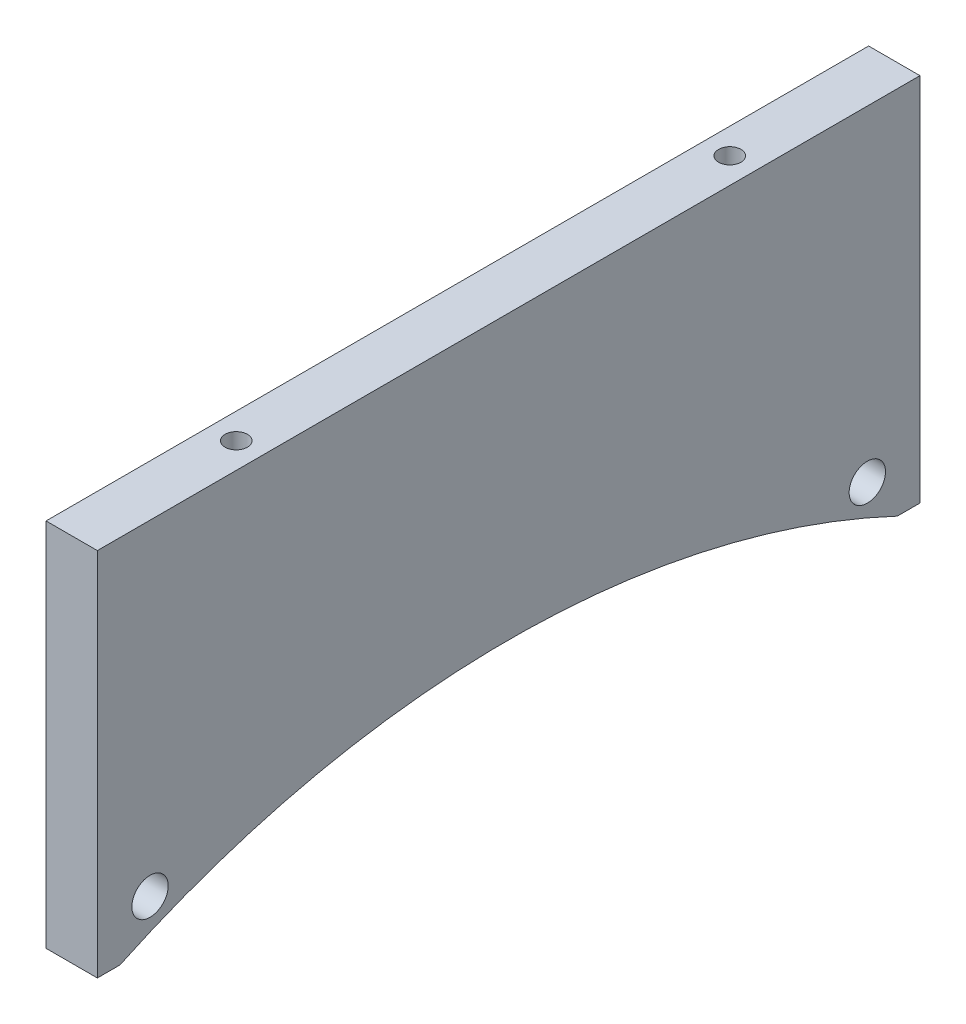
ISO-10303-21;
HEADER;
FILE_DESCRIPTION(('STEP AP214'),'2;1');
FILE_NAME('part.step','',(''),(''),'','','');
FILE_SCHEMA(('AUTOMOTIVE_DESIGN { 1 0 10303 214 1 1 1 1 }'));
ENDSEC;
DATA;
#1=APPLICATION_CONTEXT('core data for automotive mechanical design processes');
#2=APPLICATION_PROTOCOL_DEFINITION('international standard','automotive_design',2000,#1);
#3=PRODUCT_CONTEXT('',#1,'mechanical');
#4=PRODUCT('Part','Part','',(#3));
#5=PRODUCT_RELATED_PRODUCT_CATEGORY('part','',(#4));
#6=PRODUCT_DEFINITION_FORMATION('','',#4);
#7=PRODUCT_DEFINITION_CONTEXT('part definition',#1,'design');
#8=PRODUCT_DEFINITION('design','',#6,#7);
#9=PRODUCT_DEFINITION_SHAPE('','',#8);
#10=(LENGTH_UNIT() NAMED_UNIT(*) SI_UNIT(.MILLI.,.METRE.));
#11=(NAMED_UNIT(*) PLANE_ANGLE_UNIT() SI_UNIT($,.RADIAN.));
#12=(NAMED_UNIT(*) SI_UNIT($,.STERADIAN.) SOLID_ANGLE_UNIT());
#13=UNCERTAINTY_MEASURE_WITH_UNIT(LENGTH_MEASURE(1.E-05),#10,'distance_accuracy_value','');
#14=(GEOMETRIC_REPRESENTATION_CONTEXT(3) GLOBAL_UNCERTAINTY_ASSIGNED_CONTEXT((#13)) GLOBAL_UNIT_ASSIGNED_CONTEXT((#10,
#11,#12)) REPRESENTATION_CONTEXT('',''));
#15=CARTESIAN_POINT('',(0.,0.,0.));
#16=DIRECTION('',(0.,0.,1.));
#17=DIRECTION('',(1.,0.,0.));
#18=AXIS2_PLACEMENT_3D('',#15,#16,#17);
#19=CARTESIAN_POINT('',(0.,-119.684739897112,76.073980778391));
#20=DIRECTION('',(1.,0.,0.));
#21=DIRECTION('',(0.,0.,-1.));
#22=AXIS2_PLACEMENT_3D('',#19,#20,#21);
#23=PLANE('',#22);
#24=CARTESIAN_POINT('',(0.,-119.684739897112,76.073980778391));
#25=DIRECTION('',(-1.,0.,0.));
#26=DIRECTION('',(0.,0.,-1.));
#27=AXIS2_PLACEMENT_3D('',#24,#25,#26);
#28=CIRCLE('',#27,140.462);
#29=CARTESIAN_POINT('',(0.,9.2906759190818,20.4420155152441));
#30=VERTEX_POINT('',#29);
#31=CARTESIAN_POINT('',(0.,7.31526010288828,16.0692022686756));
#32=VERTEX_POINT('',#31);
#33=EDGE_CURVE('E180',#30,#32,#28,.T.);
#34=ORIENTED_EDGE('',*,*,#33,.F.);
#35=CARTESIAN_POINT('',(0.,14.1732601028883,20.701980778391));
#36=DIRECTION('',(-1.,0.,0.));
#37=DIRECTION('',(0.,0.,1.));
#38=AXIS2_PLACEMENT_3D('',#35,#36,#37);
#39=CIRCLE('',#38,4.8895);
#40=CARTESIAN_POINT('',(0.,10.9011533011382,24.3352337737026));
#41=VERTEX_POINT('',#40);
#42=EDGE_CURVE('E142',#41,#30,#39,.T.);
#43=ORIENTED_EDGE('',*,*,#42,.F.);
#44=CARTESIAN_POINT('',(0.,10.9011533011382,127.812727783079));
#45=VERTEX_POINT('',#44);
#46=EDGE_CURVE('E185',#45,#41,#28,.T.);
#47=ORIENTED_EDGE('',*,*,#46,.F.);
#48=CARTESIAN_POINT('',(0.,14.1732601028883,131.445980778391));
#49=DIRECTION('',(-1.,0.,0.));
#50=DIRECTION('',(0.,0.,1.));
#51=AXIS2_PLACEMENT_3D('',#48,#49,#50);
#52=CIRCLE('',#51,4.8895);
#53=CARTESIAN_POINT('',(0.,9.29067591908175,131.705946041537));
#54=VERTEX_POINT('',#53);
#55=EDGE_CURVE('E151',#54,#45,#52,.T.);
#56=ORIENTED_EDGE('',*,*,#55,.F.);
#57=CARTESIAN_POINT('',(0.,7.31526010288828,136.078759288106));
#58=VERTEX_POINT('',#57);
#59=EDGE_CURVE('E181',#58,#54,#28,.T.);
#60=ORIENTED_EDGE('',*,*,#59,.F.);
#61=DIRECTION('',(0.,0.,-1.));
#62=VECTOR('',#61,1.);
#63=CARTESIAN_POINT('',(0.,7.31526010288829,139.573980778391));
#64=LINE('',#63,#62);
#65=CARTESIAN_POINT('',(0.,7.31526010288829,139.573980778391));
#66=VERTEX_POINT('',#65);
#67=EDGE_CURVE('E178',#66,#58,#64,.T.);
#68=ORIENTED_EDGE('',*,*,#67,.F.);
#69=DIRECTION('',(0.,-1.,0.));
#70=VECTOR('',#69,1.);
#71=CARTESIAN_POINT('',(0.,7.31526010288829,139.573980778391));
#72=LINE('',#71,#70);
#73=CARTESIAN_POINT('',(0.,64.4652601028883,139.573980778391));
#74=VERTEX_POINT('',#73);
#75=EDGE_CURVE('E160',#74,#66,#72,.T.);
#76=ORIENTED_EDGE('',*,*,#75,.F.);
#77=DIRECTION('',(0.,0.,1.));
#78=VECTOR('',#77,1.);
#79=CARTESIAN_POINT('',(0.,64.4652601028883,12.573980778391));
#80=LINE('',#79,#78);
#81=CARTESIAN_POINT('',(0.,64.4652601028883,12.573980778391));
#82=VERTEX_POINT('',#81);
#83=EDGE_CURVE('E165',#82,#74,#80,.T.);
#84=ORIENTED_EDGE('',*,*,#83,.F.);
#85=DIRECTION('',(0.,1.,0.));
#86=VECTOR('',#85,1.);
#87=CARTESIAN_POINT('',(0.,7.31526010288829,12.573980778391));
#88=LINE('',#87,#86);
#89=CARTESIAN_POINT('',(0.,7.31526010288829,12.573980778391));
#90=VERTEX_POINT('',#89);
#91=EDGE_CURVE('E187',#90,#82,#88,.T.);
#92=ORIENTED_EDGE('',*,*,#91,.F.);
#93=DIRECTION('',(0.,0.,-1.));
#94=VECTOR('',#93,1.);
#95=CARTESIAN_POINT('',(0.,7.31526010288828,16.0692022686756));
#96=LINE('',#95,#94);
#97=EDGE_CURVE('E184',#32,#90,#96,.T.);
#98=ORIENTED_EDGE('',*,*,#97,.F.);
#99=EDGE_LOOP('',(#34,#43,#47,#56,#60,#68,#76,#84,#92,#98));
#100=FACE_BOUND('',#99,.T.);
#101=ADVANCED_FACE('F40',(#100),#23,.F.);
#102=CARTESIAN_POINT('',(7.9248,7.31526010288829,139.573980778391));
#103=DIRECTION('',(0.,0.,-1.));
#104=DIRECTION('',(0.,1.,0.));
#105=AXIS2_PLACEMENT_3D('',#102,#103,#104);
#106=PLANE('',#105);
#107=ORIENTED_EDGE('',*,*,#75,.T.);
#108=DIRECTION('',(-1.,0.,0.));
#109=VECTOR('',#108,1.);
#110=CARTESIAN_POINT('',(7.9248,7.31526010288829,139.573980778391));
#111=LINE('',#110,#109);
#112=CARTESIAN_POINT('',(7.9248,7.31526010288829,139.573980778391));
#113=VERTEX_POINT('',#112);
#114=EDGE_CURVE('E204',#113,#66,#111,.T.);
#115=ORIENTED_EDGE('',*,*,#114,.F.);
#116=DIRECTION('',(0.,-1.,0.));
#117=VECTOR('',#116,1.);
#118=CARTESIAN_POINT('',(7.9248,7.31526010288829,139.573980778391));
#119=LINE('',#118,#117);
#120=CARTESIAN_POINT('',(7.9248,64.4652601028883,139.573980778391));
#121=VERTEX_POINT('',#120);
#122=EDGE_CURVE('E161',#121,#113,#119,.T.);
#123=ORIENTED_EDGE('',*,*,#122,.F.);
#124=DIRECTION('',(-1.,0.,0.));
#125=VECTOR('',#124,1.);
#126=CARTESIAN_POINT('',(7.9248,64.4652601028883,139.573980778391));
#127=LINE('',#126,#125);
#128=EDGE_CURVE('E175',#121,#74,#127,.T.);
#129=ORIENTED_EDGE('',*,*,#128,.T.);
#130=EDGE_LOOP('',(#107,#115,#123,#129));
#131=FACE_BOUND('',#130,.T.);
#132=ADVANCED_FACE('F42',(#131),#106,.F.);
#133=CARTESIAN_POINT('',(7.9248,7.31526010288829,139.573980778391));
#134=DIRECTION('',(0.,1.,0.));
#135=DIRECTION('',(0.,0.,1.));
#136=AXIS2_PLACEMENT_3D('',#133,#134,#135);
#137=PLANE('',#136);
#138=ORIENTED_EDGE('',*,*,#67,.T.);
#139=DIRECTION('',(-1.,0.,0.));
#140=VECTOR('',#139,1.);
#141=CARTESIAN_POINT('',(7.9248,7.31526010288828,136.078759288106));
#142=LINE('',#141,#140);
#143=CARTESIAN_POINT('',(7.9248,7.31526010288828,136.078759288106));
#144=VERTEX_POINT('',#143);
#145=EDGE_CURVE('E201',#144,#58,#142,.T.);
#146=ORIENTED_EDGE('',*,*,#145,.F.);
#147=DIRECTION('',(0.,0.,-1.));
#148=VECTOR('',#147,1.);
#149=CARTESIAN_POINT('',(7.9248,7.31526010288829,139.573980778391));
#150=LINE('',#149,#148);
#151=EDGE_CURVE('E164',#113,#144,#150,.T.);
#152=ORIENTED_EDGE('',*,*,#151,.F.);
#153=ORIENTED_EDGE('',*,*,#114,.T.);
#154=EDGE_LOOP('',(#138,#146,#152,#153));
#155=FACE_BOUND('',#154,.T.);
#156=ADVANCED_FACE('F256',(#155),#137,.F.);
#157=CARTESIAN_POINT('',(7.9248,-119.684739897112,76.073980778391));
#158=DIRECTION('',(-1.,0.,0.));
#159=DIRECTION('',(0.,0.,1.));
#160=AXIS2_PLACEMENT_3D('',#157,#158,#159);
#161=CYLINDRICAL_SURFACE('',#160,140.462);
#162=CARTESIAN_POINT('',(1.01579999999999,10.9012974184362,24.3355975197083));
#163=CARTESIAN_POINT('',(1.07242411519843,10.8604844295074,24.2325873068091));
#164=CARTESIAN_POINT('',(1.12625214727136,10.818988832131,24.1282092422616));
#165=CARTESIAN_POINT('',(1.22705089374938,10.7345059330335,23.9164616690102));
#166=CARTESIAN_POINT('',(1.27400553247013,10.6915154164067,23.8090858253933));
#167=CARTESIAN_POINT('',(1.35938718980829,10.604238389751,23.5918959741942));
#168=CARTESIAN_POINT('',(1.39784000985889,10.5599562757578,23.482090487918));
#169=CARTESIAN_POINT('',(1.46486233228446,10.4700752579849,23.2600444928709));
#170=CARTESIAN_POINT('',(1.49343601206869,10.4244769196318,23.1478050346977));
#171=CARTESIAN_POINT('',(1.5366327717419,10.3375931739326,22.9347487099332));
#172=CARTESIAN_POINT('',(1.55249893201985,10.2964291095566,22.8341359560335));
#173=CARTESIAN_POINT('',(1.57475548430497,10.2134886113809,22.6320908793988));
#174=CARTESIAN_POINT('',(1.58114504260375,10.1717121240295,22.5306584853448));
#175=CARTESIAN_POINT('',(1.5841331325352,10.0878737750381,22.3277787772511));
#176=CARTESIAN_POINT('',(1.58073280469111,10.0458119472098,22.2263314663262));
#177=CARTESIAN_POINT('',(1.56431467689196,9.96173867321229,22.0242257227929));
#178=CARTESIAN_POINT('',(1.55129794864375,9.91972722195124,21.9235672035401));
#179=CARTESIAN_POINT('',(1.51259296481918,9.82733635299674,21.702916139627));
#180=CARTESIAN_POINT('',(1.48483268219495,9.77703336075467,21.583255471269));
#181=CARTESIAN_POINT('',(1.41771649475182,9.67724373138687,21.346774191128));
#182=CARTESIAN_POINT('',(1.3783476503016,9.62775807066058,21.2299569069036));
#183=CARTESIAN_POINT('',(1.28965761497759,9.52960054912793,20.9990909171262));
#184=CARTESIAN_POINT('',(1.24028728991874,9.48093404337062,20.8850591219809));
#185=CARTESIAN_POINT('',(1.13358954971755,9.38483528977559,20.660687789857));
#186=CARTESIAN_POINT('',(1.07628552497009,9.33739988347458,20.5503385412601));
#187=CARTESIAN_POINT('',(1.01579999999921,9.29052095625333,20.4416562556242));
#188=B_SPLINE_CURVE_WITH_KNOTS('',3,(#162,#163,#164,#165,#166,#167,#168,#169,#170,#171,#172,
#173,#174,#175,#176,#177,#178,#179,#180,#181,#182,#183,#184,#185,#186,#187),.UNSPECIFIED.,.F.,
.F.,(4,2,2,2,2,2,2,2,2,2,2,2,4),(0.,0.373379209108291,0.747618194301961,1.12070535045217,
1.49363455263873,1.82282798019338,2.1520503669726,2.48123440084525,2.81038175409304,
3.20796931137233,3.60600173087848,4.00603916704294,4.40492136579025),.UNSPECIFIED.);
#189=CARTESIAN_POINT('',(1.016,10.9011533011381,24.3352337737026));
#190=VERTEX_POINT('',#189);
#191=CARTESIAN_POINT('',(1.01600000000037,9.29067591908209,20.4420155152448));
#192=VERTEX_POINT('',#191);
#193=EDGE_CURVE('E286',#190,#192,#188,.T.);
#194=ORIENTED_EDGE('',*,*,#193,.T.);
#195=DIRECTION('',(-1.,0.,0.));
#196=VECTOR('',#195,1.);
#197=CARTESIAN_POINT('',(0.508,9.29067591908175,20.4420155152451));
#198=LINE('',#197,#196);
#199=EDGE_CURVE('E11',#192,#30,#198,.T.);
#200=ORIENTED_EDGE('',*,*,#199,.T.);
#201=ORIENTED_EDGE('',*,*,#33,.T.);
#202=DIRECTION('',(-1.,0.,0.));
#203=VECTOR('',#202,1.);
#204=CARTESIAN_POINT('',(7.9248,7.31526010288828,16.0692022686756));
#205=LINE('',#204,#203);
#206=CARTESIAN_POINT('',(7.9248,7.31526010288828,16.0692022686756));
#207=VERTEX_POINT('',#206);
#208=EDGE_CURVE('E198',#207,#32,#205,.T.);
#209=ORIENTED_EDGE('',*,*,#208,.F.);
#210=CARTESIAN_POINT('',(7.9248,-119.684739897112,76.073980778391));
#211=DIRECTION('',(-1.,0.,0.));
#212=DIRECTION('',(0.,0.,-1.));
#213=AXIS2_PLACEMENT_3D('',#210,#211,#212);
#214=CIRCLE('',#213,140.462);
#215=EDGE_CURVE('E167',#144,#207,#214,.T.);
#216=ORIENTED_EDGE('',*,*,#215,.F.);
#217=ORIENTED_EDGE('',*,*,#145,.T.);
#218=ORIENTED_EDGE('',*,*,#59,.T.);
#219=DIRECTION('',(-1.,0.,0.));
#220=VECTOR('',#219,1.);
#221=CARTESIAN_POINT('',(0.508,9.29067591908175,131.705946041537));
#222=LINE('',#221,#220);
#223=CARTESIAN_POINT('',(1.016,9.29067591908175,131.705946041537));
#224=VERTEX_POINT('',#223);
#225=EDGE_CURVE('E207',#54,#224,#222,.F.);
#226=ORIENTED_EDGE('',*,*,#225,.T.);
#227=CARTESIAN_POINT('',(1.01579999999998,9.29052095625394,131.706305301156));
#228=CARTESIAN_POINT('',(1.07242411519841,9.33440528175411,131.60456558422));
#229=CARTESIAN_POINT('',(1.12625214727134,9.37877278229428,131.501375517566));
#230=CARTESIAN_POINT('',(1.22705089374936,9.4685652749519,131.291824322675));
#231=CARTESIAN_POINT('',(1.27400553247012,9.51399246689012,131.185456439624));
#232=CARTESIAN_POINT('',(1.35938718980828,9.60565200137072,130.970079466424));
#233=CARTESIAN_POINT('',(1.39784000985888,9.65188143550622,130.861079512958));
#234=CARTESIAN_POINT('',(1.46486233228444,9.74512851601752,130.640425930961));
#235=CARTESIAN_POINT('',(1.49343601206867,9.79214582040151,130.528773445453));
#236=CARTESIAN_POINT('',(1.53663277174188,9.88116361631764,130.316599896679));
#237=CARTESIAN_POINT('',(1.55249893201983,9.92310579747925,130.216309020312));
#238=CARTESIAN_POINT('',(1.57475548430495,10.0071357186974,130.014714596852));
#239=CARTESIAN_POINT('',(1.58114504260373,10.0492234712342,129.913410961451));
#240=CARTESIAN_POINT('',(1.5841331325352,10.1332075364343,129.710591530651));
#241=CARTESIAN_POINT('',(1.58073280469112,10.1751038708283,129.609075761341));
#242=CARTESIAN_POINT('',(1.56431467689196,10.2583749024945,129.406638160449));
#243=CARTESIAN_POINT('',(1.55129794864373,10.299749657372,129.305716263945));
#244=CARTESIAN_POINT('',(1.51259296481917,10.3902348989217,129.084276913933));
#245=CARTESIAN_POINT('',(1.48483268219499,10.4391650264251,128.964048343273));
#246=CARTESIAN_POINT('',(1.41771649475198,10.5355967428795,128.726178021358));
#247=CARTESIAN_POINT('',(1.37834765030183,10.5830966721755,128.608539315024));
#248=CARTESIAN_POINT('',(1.28965761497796,10.6767166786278,128.375796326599));
#249=CARTESIAN_POINT('',(1.24028728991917,10.7228285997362,128.260707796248));
#250=CARTESIAN_POINT('',(1.13358954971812,10.8133176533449,128.034015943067));
#251=CARTESIAN_POINT('',(1.07628552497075,10.8576994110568,127.922403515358));
#252=CARTESIAN_POINT('',(1.01579999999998,10.9012974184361,127.812364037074));
#253=B_SPLINE_CURVE_WITH_KNOTS('',3,(#227,#228,#229,#230,#231,#232,#233,#234,#235,#236,#237,
#238,#239,#240,#241,#242,#243,#244,#245,#246,#247,#248,#249,#250,#251,#252),.UNSPECIFIED.,.F.,
.F.,(4,2,2,2,2,2,2,2,2,2,2,2,4),(0.,0.37337920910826,0.747618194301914,1.12070535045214,
1.49363455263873,1.82282798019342,2.15205036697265,2.48123440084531,2.81038175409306,
3.20796931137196,3.60600173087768,4.00603916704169,4.40492136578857),.UNSPECIFIED.);
#254=CARTESIAN_POINT('',(1.016,10.9011533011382,127.812727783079));
#255=VERTEX_POINT('',#254);
#256=EDGE_CURVE('E210',#224,#255,#253,.T.);
#257=ORIENTED_EDGE('',*,*,#256,.T.);
#258=DIRECTION('',(-1.,0.,0.));
#259=VECTOR('',#258,1.);
#260=CARTESIAN_POINT('',(0.508,10.9011533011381,127.812727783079));
#261=LINE('',#260,#259);
#262=EDGE_CURVE('E218',#255,#45,#261,.T.);
#263=ORIENTED_EDGE('',*,*,#262,.T.);
#264=ORIENTED_EDGE('',*,*,#46,.T.);
#265=DIRECTION('',(-1.,0.,0.));
#266=VECTOR('',#265,1.);
#267=CARTESIAN_POINT('',(0.508,10.9011533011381,24.3352337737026));
#268=LINE('',#267,#266);
#269=EDGE_CURVE('E48',#41,#190,#268,.F.);
#270=ORIENTED_EDGE('',*,*,#269,.T.);
#271=EDGE_LOOP('',(#194,#200,#201,#209,#216,#217,#218,#226,#257,#263,#264,#270));
#272=FACE_BOUND('',#271,.T.);
#273=ADVANCED_FACE('F220',(#272),#161,.F.);
#274=CARTESIAN_POINT('',(7.9248,7.31526010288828,16.0692022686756));
#275=DIRECTION('',(0.,1.,0.));
#276=DIRECTION('',(0.,0.,1.));
#277=AXIS2_PLACEMENT_3D('',#274,#275,#276);
#278=PLANE('',#277);
#279=ORIENTED_EDGE('',*,*,#97,.T.);
#280=DIRECTION('',(-1.,0.,0.));
#281=VECTOR('',#280,1.);
#282=CARTESIAN_POINT('',(7.9248,7.31526010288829,12.573980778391));
#283=LINE('',#282,#281);
#284=CARTESIAN_POINT('',(7.9248,7.31526010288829,12.573980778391));
#285=VERTEX_POINT('',#284);
#286=EDGE_CURVE('E195',#285,#90,#283,.T.);
#287=ORIENTED_EDGE('',*,*,#286,.F.);
#288=DIRECTION('',(0.,0.,-1.));
#289=VECTOR('',#288,1.);
#290=CARTESIAN_POINT('',(7.9248,7.31526010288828,16.0692022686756));
#291=LINE('',#290,#289);
#292=EDGE_CURVE('E169',#207,#285,#291,.T.);
#293=ORIENTED_EDGE('',*,*,#292,.F.);
#294=ORIENTED_EDGE('',*,*,#208,.T.);
#295=EDGE_LOOP('',(#279,#287,#293,#294));
#296=FACE_BOUND('',#295,.T.);
#297=ADVANCED_FACE('F249',(#296),#278,.F.);
#298=CARTESIAN_POINT('',(7.9248,7.31526010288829,12.573980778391));
#299=DIRECTION('',(0.,0.,1.));
#300=DIRECTION('',(0.,-1.,0.));
#301=AXIS2_PLACEMENT_3D('',#298,#299,#300);
#302=PLANE('',#301);
#303=ORIENTED_EDGE('',*,*,#91,.T.);
#304=DIRECTION('',(-1.,0.,0.));
#305=VECTOR('',#304,1.);
#306=CARTESIAN_POINT('',(7.9248,64.4652601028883,12.573980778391));
#307=LINE('',#306,#305);
#308=CARTESIAN_POINT('',(7.9248,64.4652601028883,12.573980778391));
#309=VERTEX_POINT('',#308);
#310=EDGE_CURVE('E192',#309,#82,#307,.T.);
#311=ORIENTED_EDGE('',*,*,#310,.F.);
#312=DIRECTION('',(0.,1.,0.));
#313=VECTOR('',#312,1.);
#314=CARTESIAN_POINT('',(7.9248,7.31526010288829,12.573980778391));
#315=LINE('',#314,#313);
#316=EDGE_CURVE('E171',#285,#309,#315,.T.);
#317=ORIENTED_EDGE('',*,*,#316,.F.);
#318=ORIENTED_EDGE('',*,*,#286,.T.);
#319=EDGE_LOOP('',(#303,#311,#317,#318));
#320=FACE_BOUND('',#319,.T.);
#321=ADVANCED_FACE('F246',(#320),#302,.F.);
#322=CARTESIAN_POINT('',(7.9248,64.4652601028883,12.573980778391));
#323=DIRECTION('',(0.,-1.,0.));
#324=DIRECTION('',(0.,0.,-1.));
#325=AXIS2_PLACEMENT_3D('',#322,#323,#324);
#326=PLANE('',#325);
#327=CARTESIAN_POINT('',(3.9624,64.4652601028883,114.173980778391));
#328=DIRECTION('',(0.,1.,0.));
#329=DIRECTION('',(0.,0.,1.));
#330=AXIS2_PLACEMENT_3D('',#327,#328,#329);
#331=CIRCLE('',#330,1.72719999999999);
#332=CARTESIAN_POINT('',(3.9624,64.4652601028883,115.901180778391));
#333=VERTEX_POINT('',#332);
#334=EDGE_CURVE('E132',#333,#333,#331,.T.);
#335=ORIENTED_EDGE('',*,*,#334,.F.);
#336=EDGE_LOOP('',(#335));
#337=FACE_BOUND('',#336,.T.);
#338=CARTESIAN_POINT('',(3.9624,64.4652601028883,37.973980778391));
#339=DIRECTION('',(0.,1.,0.));
#340=DIRECTION('',(0.,0.,1.));
#341=AXIS2_PLACEMENT_3D('',#338,#339,#340);
#342=CIRCLE('',#341,1.72719999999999);
#343=CARTESIAN_POINT('',(3.9624,64.4652601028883,39.701180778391));
#344=VERTEX_POINT('',#343);
#345=EDGE_CURVE('E131',#344,#344,#342,.T.);
#346=ORIENTED_EDGE('',*,*,#345,.F.);
#347=EDGE_LOOP('',(#346));
#348=FACE_BOUND('',#347,.T.);
#349=ORIENTED_EDGE('',*,*,#83,.T.);
#350=ORIENTED_EDGE('',*,*,#128,.F.);
#351=DIRECTION('',(0.,0.,1.));
#352=VECTOR('',#351,1.);
#353=CARTESIAN_POINT('',(7.9248,64.4652601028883,12.573980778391));
#354=LINE('',#353,#352);
#355=EDGE_CURVE('E173',#309,#121,#354,.T.);
#356=ORIENTED_EDGE('',*,*,#355,.F.);
#357=ORIENTED_EDGE('',*,*,#310,.T.);
#358=EDGE_LOOP('',(#349,#350,#356,#357));
#359=FACE_BOUND('',#358,.T.);
#360=ADVANCED_FACE('F239',(#337,#348,#359),#326,.F.);
#361=CARTESIAN_POINT('',(7.9248,-119.684739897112,76.073980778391));
#362=DIRECTION('',(1.,0.,0.));
#363=DIRECTION('',(0.,0.,-1.));
#364=AXIS2_PLACEMENT_3D('',#361,#362,#363);
#365=PLANE('',#364);
#366=CARTESIAN_POINT('',(7.9248,14.1732601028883,20.701980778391));
#367=DIRECTION('',(-1.,0.,0.));
#368=DIRECTION('',(0.,0.,1.));
#369=AXIS2_PLACEMENT_3D('',#366,#367,#368);
#370=CIRCLE('',#369,2.8067);
#371=CARTESIAN_POINT('',(7.9248,14.1732601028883,23.508680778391));
#372=VERTEX_POINT('',#371);
#373=EDGE_CURVE('E148',#372,#372,#370,.T.);
#374=ORIENTED_EDGE('',*,*,#373,.T.);
#375=EDGE_LOOP('',(#374));
#376=FACE_BOUND('',#375,.T.);
#377=CARTESIAN_POINT('',(7.9248,14.1732601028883,131.445980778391));
#378=DIRECTION('',(-1.,0.,0.));
#379=DIRECTION('',(0.,0.,1.));
#380=AXIS2_PLACEMENT_3D('',#377,#378,#379);
#381=CIRCLE('',#380,2.8067);
#382=CARTESIAN_POINT('',(7.9248,14.1732601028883,134.252680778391));
#383=VERTEX_POINT('',#382);
#384=EDGE_CURVE('E157',#383,#383,#381,.T.);
#385=ORIENTED_EDGE('',*,*,#384,.T.);
#386=EDGE_LOOP('',(#385));
#387=FACE_BOUND('',#386,.T.);
#388=ORIENTED_EDGE('',*,*,#122,.T.);
#389=ORIENTED_EDGE('',*,*,#151,.T.);
#390=ORIENTED_EDGE('',*,*,#215,.T.);
#391=ORIENTED_EDGE('',*,*,#292,.T.);
#392=ORIENTED_EDGE('',*,*,#316,.T.);
#393=ORIENTED_EDGE('',*,*,#355,.T.);
#394=EDGE_LOOP('',(#388,#389,#390,#391,#392,#393));
#395=FACE_BOUND('',#394,.T.);
#396=ADVANCED_FACE('F229',(#376,#387,#395),#365,.T.);
#397=CARTESIAN_POINT('',(1.016,14.1732601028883,131.445980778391));
#398=DIRECTION('',(-1.,0.,0.));
#399=DIRECTION('',(0.,0.,1.));
#400=AXIS2_PLACEMENT_3D('',#397,#398,#399);
#401=CONICAL_SURFACE('',#400,4.8895,0.715584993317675);
#402=CARTESIAN_POINT('',(3.41198731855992,14.1732601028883,131.445980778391));
#403=DIRECTION('',(-1.,0.,0.));
#404=DIRECTION('',(0.,0.,1.));
#405=AXIS2_PLACEMENT_3D('',#402,#403,#404);
#406=CIRCLE('',#405,2.8067);
#407=CARTESIAN_POINT('',(3.41198731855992,14.1732601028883,134.252680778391));
#408=VERTEX_POINT('',#407);
#409=EDGE_CURVE('E154',#408,#408,#406,.T.);
#410=ORIENTED_EDGE('',*,*,#409,.F.);
#411=EDGE_LOOP('',(#410));
#412=FACE_BOUND('',#411,.T.);
#413=CARTESIAN_POINT('',(1.016,14.1732601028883,131.445980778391));
#414=DIRECTION('',(-1.,0.,0.));
#415=DIRECTION('',(0.,0.,1.));
#416=AXIS2_PLACEMENT_3D('',#413,#414,#415);
#417=CIRCLE('',#416,4.8895);
#418=EDGE_CURVE('E62',#224,#255,#417,.T.);
#419=ORIENTED_EDGE('',*,*,#418,.T.);
#420=ORIENTED_EDGE('',*,*,#256,.F.);
#421=EDGE_LOOP('',(#419,#420));
#422=FACE_BOUND('',#421,.T.);
#423=ADVANCED_FACE('F223',(#412,#422),#401,.F.);
#424=CARTESIAN_POINT('',(0.,14.1732601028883,131.445980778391));
#425=DIRECTION('',(-1.,0.,0.));
#426=DIRECTION('',(0.,0.,1.));
#427=AXIS2_PLACEMENT_3D('',#424,#425,#426);
#428=CYLINDRICAL_SURFACE('',#427,4.8895);
#429=ORIENTED_EDGE('',*,*,#418,.F.);
#430=ORIENTED_EDGE('',*,*,#225,.F.);
#431=ORIENTED_EDGE('',*,*,#55,.T.);
#432=ORIENTED_EDGE('',*,*,#262,.F.);
#433=EDGE_LOOP('',(#429,#430,#431,#432));
#434=FACE_BOUND('',#433,.T.);
#435=ADVANCED_FACE('F228',(#434),#428,.F.);
#436=CARTESIAN_POINT('',(0.,14.1732601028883,131.445980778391));
#437=DIRECTION('',(-1.,0.,0.));
#438=DIRECTION('',(0.,0.,1.));
#439=AXIS2_PLACEMENT_3D('',#436,#437,#438);
#440=CYLINDRICAL_SURFACE('',#439,2.8067);
#441=ORIENTED_EDGE('',*,*,#384,.F.);
#442=EDGE_LOOP('',(#441));
#443=FACE_BOUND('',#442,.T.);
#444=ORIENTED_EDGE('',*,*,#409,.T.);
#445=EDGE_LOOP('',(#444));
#446=FACE_BOUND('',#445,.T.);
#447=ADVANCED_FACE('F232',(#443,#446),#440,.F.);
#448=CARTESIAN_POINT('',(0.,14.1732601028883,20.701980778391));
#449=DIRECTION('',(-1.,0.,0.));
#450=DIRECTION('',(0.,0.,1.));
#451=AXIS2_PLACEMENT_3D('',#448,#449,#450);
#452=CYLINDRICAL_SURFACE('',#451,4.8895);
#453=CARTESIAN_POINT('',(1.016,14.1732601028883,20.701980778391));
#454=DIRECTION('',(-1.,0.,0.));
#455=DIRECTION('',(0.,0.,1.));
#456=AXIS2_PLACEMENT_3D('',#453,#454,#455);
#457=CIRCLE('',#456,4.8895);
#458=EDGE_CURVE('E54',#190,#192,#457,.T.);
#459=ORIENTED_EDGE('',*,*,#458,.F.);
#460=ORIENTED_EDGE('',*,*,#269,.F.);
#461=ORIENTED_EDGE('',*,*,#42,.T.);
#462=ORIENTED_EDGE('',*,*,#199,.F.);
#463=EDGE_LOOP('',(#459,#460,#461,#462));
#464=FACE_BOUND('',#463,.T.);
#465=ADVANCED_FACE('F235',(#464),#452,.F.);
#466=CARTESIAN_POINT('',(1.016,14.1732601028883,20.701980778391));
#467=DIRECTION('',(-1.,0.,0.));
#468=DIRECTION('',(0.,0.,1.));
#469=AXIS2_PLACEMENT_3D('',#466,#467,#468);
#470=CONICAL_SURFACE('',#469,4.8895,0.715584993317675);
#471=CARTESIAN_POINT('',(3.41198731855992,14.1732601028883,20.701980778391));
#472=DIRECTION('',(-1.,0.,0.));
#473=DIRECTION('',(0.,0.,1.));
#474=AXIS2_PLACEMENT_3D('',#471,#472,#473);
#475=CIRCLE('',#474,2.8067);
#476=CARTESIAN_POINT('',(3.41198731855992,14.1732601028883,23.508680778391));
#477=VERTEX_POINT('',#476);
#478=EDGE_CURVE('E145',#477,#477,#475,.T.);
#479=ORIENTED_EDGE('',*,*,#478,.F.);
#480=EDGE_LOOP('',(#479));
#481=FACE_BOUND('',#480,.T.);
#482=ORIENTED_EDGE('',*,*,#458,.T.);
#483=ORIENTED_EDGE('',*,*,#193,.F.);
#484=EDGE_LOOP('',(#482,#483));
#485=FACE_BOUND('',#484,.T.);
#486=ADVANCED_FACE('F291',(#481,#485),#470,.F.);
#487=CARTESIAN_POINT('',(0.,14.1732601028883,20.701980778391));
#488=DIRECTION('',(-1.,0.,0.));
#489=DIRECTION('',(0.,0.,1.));
#490=AXIS2_PLACEMENT_3D('',#487,#488,#489);
#491=CYLINDRICAL_SURFACE('',#490,2.8067);
#492=ORIENTED_EDGE('',*,*,#373,.F.);
#493=EDGE_LOOP('',(#492));
#494=FACE_BOUND('',#493,.T.);
#495=ORIENTED_EDGE('',*,*,#478,.T.);
#496=EDGE_LOOP('',(#495));
#497=FACE_BOUND('',#496,.T.);
#498=ADVANCED_FACE('F295',(#494,#497),#491,.F.);
#499=CARTESIAN_POINT('',(3.9624,54.3052601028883,37.973980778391));
#500=DIRECTION('',(0.,1.,0.));
#501=DIRECTION('',(0.,0.,1.));
#502=AXIS2_PLACEMENT_3D('',#499,#500,#501);
#503=CONICAL_SURFACE('',#502,1.7272,1.02974425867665);
#504=CARTESIAN_POINT('',(3.9624,53.2674536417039,37.973980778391));
#505=VERTEX_POINT('',#504);
#506=VERTEX_LOOP('',#505);
#507=FACE_BOUND('',#506,.T.);
#508=CARTESIAN_POINT('',(3.9624,54.3052601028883,37.973980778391));
#509=DIRECTION('',(0.,1.,0.));
#510=DIRECTION('',(0.,0.,1.));
#511=AXIS2_PLACEMENT_3D('',#508,#509,#510);
#512=CIRCLE('',#511,1.7272);
#513=CARTESIAN_POINT('',(3.9624,54.3052601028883,39.701180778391));
#514=VERTEX_POINT('',#513);
#515=EDGE_CURVE('E135',#514,#514,#512,.T.);
#516=ORIENTED_EDGE('',*,*,#515,.T.);
#517=EDGE_LOOP('',(#516));
#518=FACE_BOUND('',#517,.T.);
#519=ADVANCED_FACE('F299',(#507,#518),#503,.F.);
#520=CARTESIAN_POINT('',(3.9624,64.4652601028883,37.973980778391));
#521=DIRECTION('',(0.,1.,0.));
#522=DIRECTION('',(0.,0.,1.));
#523=AXIS2_PLACEMENT_3D('',#520,#521,#522);
#524=CYLINDRICAL_SURFACE('',#523,1.7272);
#525=ORIENTED_EDGE('',*,*,#515,.F.);
#526=EDGE_LOOP('',(#525));
#527=FACE_BOUND('',#526,.T.);
#528=ORIENTED_EDGE('',*,*,#345,.T.);
#529=EDGE_LOOP('',(#528));
#530=FACE_BOUND('',#529,.T.);
#531=ADVANCED_FACE('F125',(#527,#530),#524,.F.);
#532=CARTESIAN_POINT('',(3.9624,54.3052601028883,114.173980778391));
#533=DIRECTION('',(0.,1.,0.));
#534=DIRECTION('',(0.,0.,1.));
#535=AXIS2_PLACEMENT_3D('',#532,#533,#534);
#536=CONICAL_SURFACE('',#535,1.7272,1.02974425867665);
#537=CARTESIAN_POINT('',(3.9624,53.2674536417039,114.173980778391));
#538=VERTEX_POINT('',#537);
#539=VERTEX_LOOP('',#538);
#540=FACE_BOUND('',#539,.T.);
#541=CARTESIAN_POINT('',(3.9624,54.3052601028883,114.173980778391));
#542=DIRECTION('',(0.,1.,0.));
#543=DIRECTION('',(0.,0.,1.));
#544=AXIS2_PLACEMENT_3D('',#541,#542,#543);
#545=CIRCLE('',#544,1.7272);
#546=CARTESIAN_POINT('',(3.9624,54.3052601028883,115.901180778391));
#547=VERTEX_POINT('',#546);
#548=EDGE_CURVE('E129',#547,#547,#545,.T.);
#549=ORIENTED_EDGE('',*,*,#548,.T.);
#550=EDGE_LOOP('',(#549));
#551=FACE_BOUND('',#550,.T.);
#552=ADVANCED_FACE('F121',(#540,#551),#536,.F.);
#553=CARTESIAN_POINT('',(3.9624,64.4652601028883,114.173980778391));
#554=DIRECTION('',(0.,1.,0.));
#555=DIRECTION('',(0.,0.,1.));
#556=AXIS2_PLACEMENT_3D('',#553,#554,#555);
#557=CYLINDRICAL_SURFACE('',#556,1.7272);
#558=ORIENTED_EDGE('',*,*,#548,.F.);
#559=EDGE_LOOP('',(#558));
#560=FACE_BOUND('',#559,.T.);
#561=ORIENTED_EDGE('',*,*,#334,.T.);
#562=EDGE_LOOP('',(#561));
#563=FACE_BOUND('',#562,.T.);
#564=ADVANCED_FACE('F124',(#560,#563),#557,.F.);
#565=CLOSED_SHELL('',(#101,#132,#156,#273,#297,#321,#360,#396,#423,#435,#447,#465,#486,#498,
#519,#531,#552,#564));
#566=MANIFOLD_SOLID_BREP('B2',#565);
#567=ADVANCED_BREP_SHAPE_REPRESENTATION('',(#18,#566),#14);
#568=SHAPE_DEFINITION_REPRESENTATION(#9,#567);
ENDSEC;
END-ISO-10303-21;
